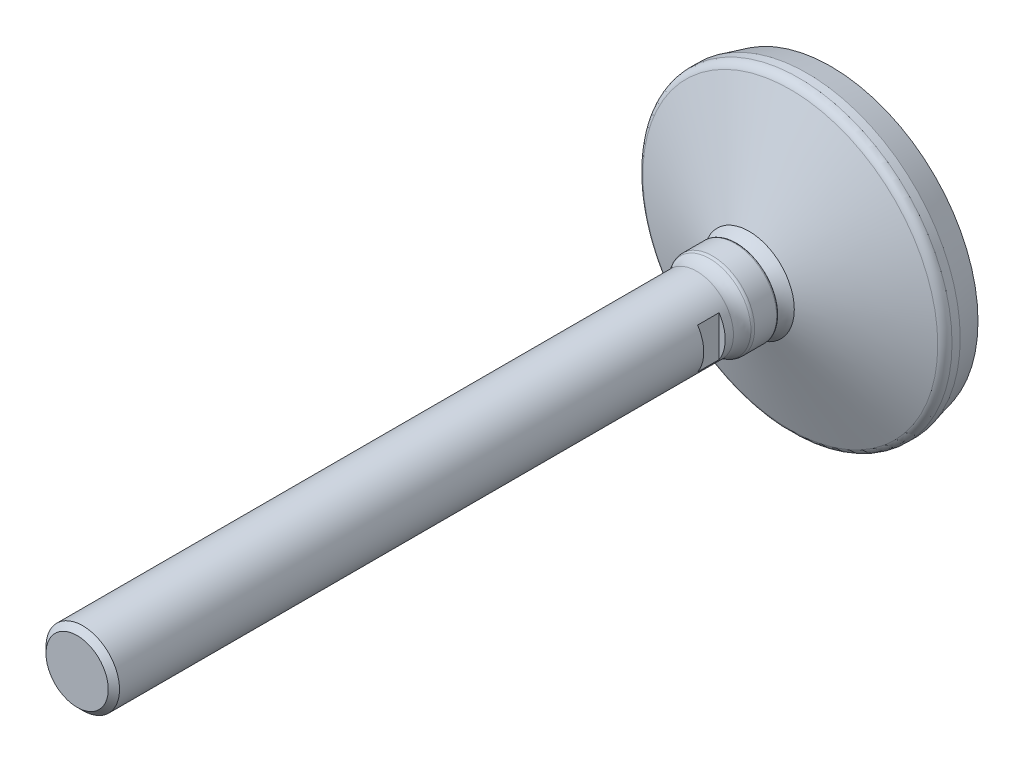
ISO-10303-21;
HEADER;
FILE_DESCRIPTION(('STEP AP214'),'2;1');
FILE_NAME('part.step','',(''),(''),'','','');
FILE_SCHEMA(('AUTOMOTIVE_DESIGN { 1 0 10303 214 1 1 1 1 }'));
ENDSEC;
DATA;
#1=APPLICATION_CONTEXT('core data for automotive mechanical design processes');
#2=APPLICATION_PROTOCOL_DEFINITION('international standard','automotive_design',2000,#1);
#3=PRODUCT_CONTEXT('',#1,'mechanical');
#4=PRODUCT('Part','Part','',(#3));
#5=PRODUCT_RELATED_PRODUCT_CATEGORY('part','',(#4));
#6=PRODUCT_DEFINITION_FORMATION('','',#4);
#7=PRODUCT_DEFINITION_CONTEXT('part definition',#1,'design');
#8=PRODUCT_DEFINITION('design','',#6,#7);
#9=PRODUCT_DEFINITION_SHAPE('','',#8);
#10=(LENGTH_UNIT() NAMED_UNIT(*) SI_UNIT(.MILLI.,.METRE.));
#11=(NAMED_UNIT(*) PLANE_ANGLE_UNIT() SI_UNIT($,.RADIAN.));
#12=(NAMED_UNIT(*) SI_UNIT($,.STERADIAN.) SOLID_ANGLE_UNIT());
#13=UNCERTAINTY_MEASURE_WITH_UNIT(LENGTH_MEASURE(1.E-05),#10,'distance_accuracy_value','');
#14=(GEOMETRIC_REPRESENTATION_CONTEXT(3) GLOBAL_UNCERTAINTY_ASSIGNED_CONTEXT((#13)) GLOBAL_UNIT_ASSIGNED_CONTEXT((#10,
#11,#12)) REPRESENTATION_CONTEXT('',''));
#15=CARTESIAN_POINT('',(0.,0.,0.));
#16=DIRECTION('',(0.,0.,1.));
#17=DIRECTION('',(1.,0.,0.));
#18=AXIS2_PLACEMENT_3D('',#15,#16,#17);
#19=CARTESIAN_POINT('',(0.,0.,35.3578436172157));
#20=DIRECTION('',(0.,0.,-1.));
#21=DIRECTION('',(1.,0.,0.));
#22=AXIS2_PLACEMENT_3D('',#19,#20,#21);
#23=TOROIDAL_SURFACE('',#22,23.0591361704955,12.);
#24=CARTESIAN_POINT('',(0.,0.,26.7));
#25=DIRECTION('',(0.,0.,-1.));
#26=DIRECTION('',(1.,0.,0.));
#27=AXIS2_PLACEMENT_3D('',#24,#25,#26);
#28=CIRCLE('',#27,14.75);
#29=CARTESIAN_POINT('',(14.75,0.,26.7));
#30=VERTEX_POINT('',#29);
#31=EDGE_CURVE('E86',#30,#30,#28,.T.);
#32=ORIENTED_EDGE('',*,*,#31,.F.);
#33=EDGE_LOOP('',(#32));
#34=FACE_BOUND('',#33,.T.);
#35=CARTESIAN_POINT('',(0.,0.,30.7));
#36=DIRECTION('',(0.,0.,-1.));
#37=DIRECTION('',(1.,0.,0.));
#38=AXIS2_PLACEMENT_3D('',#35,#36,#37);
#39=CIRCLE('',#38,12.);
#40=CARTESIAN_POINT('',(12.,0.,30.7));
#41=VERTEX_POINT('',#40);
#42=EDGE_CURVE('E61',#41,#41,#39,.T.);
#43=ORIENTED_EDGE('',*,*,#42,.T.);
#44=EDGE_LOOP('',(#43));
#45=FACE_BOUND('',#44,.T.);
#46=ADVANCED_FACE('F14',(#34,#45),#23,.F.);
#47=CARTESIAN_POINT('',(0.,0.,26.7));
#48=DIRECTION('',(0.,0.,-1.));
#49=DIRECTION('',(1.,0.,0.));
#50=AXIS2_PLACEMENT_3D('',#47,#48,#49);
#51=CONICAL_SURFACE('',#50,14.75,1.18784675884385);
#52=CARTESIAN_POINT('',(0.,0.,13.2569409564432));
#53=DIRECTION('',(0.,0.,-1.));
#54=DIRECTION('',(1.,0.,0.));
#55=AXIS2_PLACEMENT_3D('',#52,#53,#54);
#56=CIRCLE('',#55,48.1209740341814);
#57=CARTESIAN_POINT('',(48.1209740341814,0.,13.2569409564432));
#58=VERTEX_POINT('',#57);
#59=EDGE_CURVE('E89',#58,#58,#56,.T.);
#60=CARTESIAN_POINT('',(48.1209740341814,0.,13.2569409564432));
#61=CARTESIAN_POINT('',(47.7733597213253,0.,13.3969728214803));
#62=CARTESIAN_POINT('',(47.4257454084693,0.,13.5370046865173));
#63=CARTESIAN_POINT('',(46.7305167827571,0.,13.8170684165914));
#64=CARTESIAN_POINT('',(46.3829024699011,0.,13.9571002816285));
#65=CARTESIAN_POINT('',(45.687673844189,0.,14.2371640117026));
#66=CARTESIAN_POINT('',(45.3400595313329,0.,14.3771958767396));
#67=CARTESIAN_POINT('',(44.6448309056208,0.,14.6572596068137));
#68=CARTESIAN_POINT('',(44.2972165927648,0.,14.7972914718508));
#69=CARTESIAN_POINT('',(43.6019879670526,0.,15.0773552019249));
#70=CARTESIAN_POINT('',(43.2543736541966,0.,15.2173870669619));
#71=CARTESIAN_POINT('',(42.5591450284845,0.,15.497450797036));
#72=CARTESIAN_POINT('',(42.2115307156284,0.,15.6374826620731));
#73=CARTESIAN_POINT('',(41.5163020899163,0.,15.9175463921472));
#74=CARTESIAN_POINT('',(41.1686877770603,0.,16.0575782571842));
#75=CARTESIAN_POINT('',(40.4734591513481,0.,16.3376419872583));
#76=CARTESIAN_POINT('',(40.1258448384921,0.,16.4776738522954));
#77=CARTESIAN_POINT('',(39.43061621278,0.,16.7577375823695));
#78=CARTESIAN_POINT('',(39.0830018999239,0.,16.8977694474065));
#79=CARTESIAN_POINT('',(38.3877732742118,0.,17.1778331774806));
#80=CARTESIAN_POINT('',(38.0401589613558,0.,17.3178650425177));
#81=CARTESIAN_POINT('',(37.3449303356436,0.,17.5979287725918));
#82=CARTESIAN_POINT('',(36.9973160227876,0.,17.7379606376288));
#83=CARTESIAN_POINT('',(36.3020873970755,0.,18.0180243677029));
#84=CARTESIAN_POINT('',(35.9544730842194,0.,18.15805623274));
#85=CARTESIAN_POINT('',(35.2592444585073,0.,18.4381199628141));
#86=CARTESIAN_POINT('',(34.9116301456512,0.,18.5781518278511));
#87=CARTESIAN_POINT('',(34.2164015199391,0.,18.8582155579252));
#88=CARTESIAN_POINT('',(33.8687872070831,0.,18.9982474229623));
#89=CARTESIAN_POINT('',(33.173558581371,0.,19.2783111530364));
#90=CARTESIAN_POINT('',(32.8259442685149,0.,19.4183430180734));
#91=CARTESIAN_POINT('',(32.1307156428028,0.,19.6984067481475));
#92=CARTESIAN_POINT('',(31.7831013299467,0.,19.8384386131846));
#93=CARTESIAN_POINT('',(31.0878727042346,0.,20.1185023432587));
#94=CARTESIAN_POINT('',(30.7402583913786,0.,20.2585342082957));
#95=CARTESIAN_POINT('',(30.0450297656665,0.,20.5385979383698));
#96=CARTESIAN_POINT('',(29.6974154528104,0.,20.6786298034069));
#97=CARTESIAN_POINT('',(29.0021868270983,0.,20.958693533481));
#98=CARTESIAN_POINT('',(28.6545725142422,0.,21.098725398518));
#99=CARTESIAN_POINT('',(27.9593438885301,0.,21.3787891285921));
#100=CARTESIAN_POINT('',(27.6117295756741,0.,21.5188209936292));
#101=CARTESIAN_POINT('',(26.916500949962,0.,21.7988847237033));
#102=CARTESIAN_POINT('',(26.5688866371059,0.,21.9389165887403));
#103=CARTESIAN_POINT('',(25.8736580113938,0.,22.2189803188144));
#104=CARTESIAN_POINT('',(25.5260436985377,0.,22.3590121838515));
#105=CARTESIAN_POINT('',(24.8308150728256,0.,22.6390759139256));
#106=CARTESIAN_POINT('',(24.4832007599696,0.,22.7791077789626));
#107=CARTESIAN_POINT('',(23.7879721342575,0.,23.0591715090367));
#108=CARTESIAN_POINT('',(23.4403578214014,0.,23.1992033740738));
#109=CARTESIAN_POINT('',(22.7451291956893,0.,23.4792671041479));
#110=CARTESIAN_POINT('',(22.3975148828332,0.,23.6192989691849));
#111=CARTESIAN_POINT('',(21.7022862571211,0.,23.899362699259));
#112=CARTESIAN_POINT('',(21.3546719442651,0.,24.0393945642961));
#113=CARTESIAN_POINT('',(20.6594433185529,0.,24.3194582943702));
#114=CARTESIAN_POINT('',(20.3118290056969,0.,24.4594901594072));
#115=CARTESIAN_POINT('',(19.6166003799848,0.,24.7395538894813));
#116=CARTESIAN_POINT('',(19.2689860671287,0.,24.8795857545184));
#117=CARTESIAN_POINT('',(18.5737574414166,0.,25.1596494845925));
#118=CARTESIAN_POINT('',(18.2261431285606,0.,25.2996813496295));
#119=CARTESIAN_POINT('',(17.5309145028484,0.,25.5797450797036));
#120=CARTESIAN_POINT('',(17.1833001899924,0.,25.7197769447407));
#121=CARTESIAN_POINT('',(16.4880715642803,0.,25.9998406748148));
#122=CARTESIAN_POINT('',(16.1404572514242,0.,26.1398725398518));
#123=CARTESIAN_POINT('',(15.4452286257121,0.,26.4199362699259));
#124=CARTESIAN_POINT('',(15.0976143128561,0.,26.559968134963));
#125=CARTESIAN_POINT('',(14.75,0.,26.7));
#126=B_SPLINE_CURVE_WITH_KNOTS('',3,(#60,#61,#62,#63,#64,#65,#66,#67,#68,#69,#70,#71,#72,#73,
#74,#75,#76,#77,#78,#79,#80,#81,#82,#83,#84,#85,#86,#87,#88,#89,#90,#91,#92,#93,#94,#95,#96,#97,
#98,#99,#100,#101,#102,#103,#104,#105,#106,#107,#108,#109,#110,#111,#112,#113,#114,#115,#116,
#117,#118,#119,#120,#121,#122,#123,#124,#125),.UNSPECIFIED.,.F.,.F.,(4,2,2,2,2,2,2,2,2,2,2,2,2,
2,2,2,2,2,2,2,2,2,2,2,2,2,2,2,2,2,2,2,4),(0.,1.12427830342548,2.24855660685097,3.37283491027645,
4.49711321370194,5.62139151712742,6.7456698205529,7.86994812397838,8.99422642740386,
10.1185047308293,11.2427830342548,12.3670613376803,13.4913396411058,14.6156179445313,
15.7398962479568,16.8641745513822,17.9884528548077,19.1127311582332,20.2370094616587,
21.3612877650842,22.4855660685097,23.6098443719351,24.7341226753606,25.8584009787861,
26.9826792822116,28.1069575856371,29.2312358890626,30.3555141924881,31.4797924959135,
32.604070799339,33.7283491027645,34.85262740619,35.9769057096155),.UNSPECIFIED.);
#127=EDGE_CURVE('BSEAM147',#58,#30,#126,.T.);
#128=ORIENTED_EDGE('',*,*,#59,.F.);
#129=ORIENTED_EDGE('',*,*,#31,.T.);
#130=ORIENTED_EDGE('',*,*,#127,.T.);
#131=ORIENTED_EDGE('',*,*,#127,.F.);
#132=EDGE_LOOP('',(#128,#130,#129,#131));
#133=FACE_BOUND('',#132,.T.);
#134=ADVANCED_FACE('F147',(#133),#51,.T.);
#135=CARTESIAN_POINT('',(0.,0.,10.4742413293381));
#136=DIRECTION('',(0.,0.,-1.));
#137=DIRECTION('',(1.,0.,0.));
#138=AXIS2_PLACEMENT_3D('',#135,#136,#137);
#139=TOROIDAL_SURFACE('',#138,47.,3.);
#140=ORIENTED_EDGE('',*,*,#59,.T.);
#141=EDGE_LOOP('',(#140));
#142=FACE_BOUND('',#141,.T.);
#143=CARTESIAN_POINT('',(0.,0.,10.4742413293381));
#144=DIRECTION('',(0.,0.,-1.));
#145=DIRECTION('',(1.,0.,0.));
#146=AXIS2_PLACEMENT_3D('',#143,#144,#145);
#147=CIRCLE('',#146,50.);
#148=CARTESIAN_POINT('',(50.,0.,10.4742413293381));
#149=VERTEX_POINT('',#148);
#150=EDGE_CURVE('E92',#149,#149,#147,.T.);
#151=ORIENTED_EDGE('',*,*,#150,.F.);
#152=EDGE_LOOP('',(#151));
#153=FACE_BOUND('',#152,.T.);
#154=ADVANCED_FACE('F153',(#142,#153),#139,.T.);
#155=CARTESIAN_POINT('',(0.,0.,0.));
#156=DIRECTION('',(0.,0.,-1.));
#157=DIRECTION('',(1.,0.,0.));
#158=AXIS2_PLACEMENT_3D('',#155,#156,#157);
#159=CYLINDRICAL_SURFACE('',#158,50.);
#160=CARTESIAN_POINT('',(0.,0.,7.8));
#161=DIRECTION('',(0.,0.,-1.));
#162=DIRECTION('',(1.,0.,0.));
#163=AXIS2_PLACEMENT_3D('',#160,#161,#162);
#164=CIRCLE('',#163,50.);
#165=CARTESIAN_POINT('',(50.,0.,7.8));
#166=VERTEX_POINT('',#165);
#167=EDGE_CURVE('E95',#166,#166,#164,.T.);
#168=ORIENTED_EDGE('',*,*,#167,.F.);
#169=EDGE_LOOP('',(#168));
#170=FACE_BOUND('',#169,.T.);
#171=ORIENTED_EDGE('',*,*,#150,.T.);
#172=EDGE_LOOP('',(#171));
#173=FACE_BOUND('',#172,.T.);
#174=ADVANCED_FACE('F198',(#170,#173),#159,.T.);
#175=CARTESIAN_POINT('',(0.,0.,7.8));
#176=DIRECTION('',(0.,0.,1.));
#177=DIRECTION('',(-1.,0.,0.));
#178=AXIS2_PLACEMENT_3D('',#175,#176,#177);
#179=CONICAL_SURFACE('',#178,50.,0.251002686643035);
#180=CARTESIAN_POINT('',(0.,0.,0.));
#181=DIRECTION('',(0.,0.,-1.));
#182=DIRECTION('',(1.,0.,0.));
#183=AXIS2_PLACEMENT_3D('',#180,#181,#182);
#184=CIRCLE('',#183,48.);
#185=CARTESIAN_POINT('',(48.,0.,0.));
#186=VERTEX_POINT('',#185);
#187=EDGE_CURVE('E98',#186,#186,#184,.T.);
#188=ORIENTED_EDGE('',*,*,#187,.F.);
#189=EDGE_LOOP('',(#188));
#190=FACE_BOUND('',#189,.T.);
#191=ORIENTED_EDGE('',*,*,#167,.T.);
#192=EDGE_LOOP('',(#191));
#193=FACE_BOUND('',#192,.T.);
#194=ADVANCED_FACE('F194',(#190,#193),#179,.T.);
#195=CARTESIAN_POINT('',(48.,0.,0.));
#196=DIRECTION('',(0.,0.,1.));
#197=DIRECTION('',(-1.,0.,0.));
#198=AXIS2_PLACEMENT_3D('',#195,#196,#197);
#199=PLANE('',#198);
#200=ORIENTED_EDGE('',*,*,#187,.T.);
#201=EDGE_LOOP('',(#200));
#202=FACE_BOUND('',#201,.T.);
#203=ADVANCED_FACE('F187',(#202),#199,.F.);
#204=CARTESIAN_POINT('',(0.,0.,14.));
#205=DIRECTION('',(0.,0.,-1.));
#206=DIRECTION('',(0.,1.,0.));
#207=AXIS2_PLACEMENT_3D('',#204,#205,#206);
#208=CYLINDRICAL_SURFACE('',#207,12.);
#209=CARTESIAN_POINT('',(0.,0.,43.8));
#210=DIRECTION('',(0.,0.,-1.));
#211=DIRECTION('',(0.,1.,0.));
#212=AXIS2_PLACEMENT_3D('',#209,#210,#211);
#213=CIRCLE('',#212,12.);
#214=CARTESIAN_POINT('',(0.,12.,43.8));
#215=VERTEX_POINT('',#214);
#216=EDGE_CURVE('E107',#215,#215,#213,.T.);
#217=ORIENTED_EDGE('',*,*,#216,.F.);
#218=EDGE_LOOP('',(#217));
#219=FACE_BOUND('',#218,.T.);
#220=DIRECTION('',(0.,0.,-1.));
#221=VECTOR('',#220,1.);
#222=CARTESIAN_POINT('',(10.,-6.6332495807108,14.));
#223=LINE('',#222,#221);
#224=CARTESIAN_POINT('',(10.,-6.6332495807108,46.5));
#225=VERTEX_POINT('',#224);
#226=CARTESIAN_POINT('',(10.,-6.6332495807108,53.5));
#227=VERTEX_POINT('',#226);
#228=EDGE_CURVE('E77',#225,#227,#223,.F.);
#229=ORIENTED_EDGE('',*,*,#228,.T.);
#230=CARTESIAN_POINT('',(0.,0.,53.5));
#231=DIRECTION('',(0.,0.,1.));
#232=DIRECTION('',(0.,-1.,0.));
#233=AXIS2_PLACEMENT_3D('',#230,#231,#232);
#234=CIRCLE('',#233,12.);
#235=CARTESIAN_POINT('',(10.,6.6332495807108,53.5));
#236=VERTEX_POINT('',#235);
#237=EDGE_CURVE('E9',#227,#236,#234,.T.);
#238=ORIENTED_EDGE('',*,*,#237,.T.);
#239=DIRECTION('',(0.,0.,-1.));
#240=VECTOR('',#239,1.);
#241=CARTESIAN_POINT('',(10.,6.6332495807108,14.));
#242=LINE('',#241,#240);
#243=CARTESIAN_POINT('',(10.,6.6332495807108,46.5));
#244=VERTEX_POINT('',#243);
#245=EDGE_CURVE('E17',#236,#244,#242,.T.);
#246=ORIENTED_EDGE('',*,*,#245,.T.);
#247=CARTESIAN_POINT('',(0.,0.,46.5));
#248=DIRECTION('',(0.,0.,1.));
#249=DIRECTION('',(0.,-1.,0.));
#250=AXIS2_PLACEMENT_3D('',#247,#248,#249);
#251=CIRCLE('',#250,12.);
#252=EDGE_CURVE('E63',#225,#244,#251,.T.);
#253=ORIENTED_EDGE('',*,*,#252,.F.);
#254=EDGE_LOOP('',(#229,#238,#246,#253));
#255=FACE_BOUND('',#254,.T.);
#256=DIRECTION('',(0.,0.,-1.));
#257=VECTOR('',#256,1.);
#258=CARTESIAN_POINT('',(-10.,6.6332495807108,14.));
#259=LINE('',#258,#257);
#260=CARTESIAN_POINT('',(-10.,6.6332495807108,46.5));
#261=VERTEX_POINT('',#260);
#262=CARTESIAN_POINT('',(-10.,6.6332495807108,53.5));
#263=VERTEX_POINT('',#262);
#264=EDGE_CURVE('E60',#261,#263,#259,.F.);
#265=ORIENTED_EDGE('',*,*,#264,.T.);
#266=CARTESIAN_POINT('',(-10.,-6.6332495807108,53.5));
#267=VERTEX_POINT('',#266);
#268=EDGE_CURVE('E23',#263,#267,#234,.T.);
#269=ORIENTED_EDGE('',*,*,#268,.T.);
#270=DIRECTION('',(0.,0.,-1.));
#271=VECTOR('',#270,1.);
#272=CARTESIAN_POINT('',(-10.,-6.6332495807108,14.));
#273=LINE('',#272,#271);
#274=CARTESIAN_POINT('',(-10.,-6.6332495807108,46.5));
#275=VERTEX_POINT('',#274);
#276=EDGE_CURVE('E67',#267,#275,#273,.T.);
#277=ORIENTED_EDGE('',*,*,#276,.T.);
#278=EDGE_CURVE('E55',#261,#275,#251,.T.);
#279=ORIENTED_EDGE('',*,*,#278,.F.);
#280=EDGE_LOOP('',(#265,#269,#277,#279));
#281=FACE_BOUND('',#280,.T.);
#282=CARTESIAN_POINT('',(0.,0.,244.1595));
#283=DIRECTION('',(0.,0.,-1.));
#284=DIRECTION('',(0.,1.,0.));
#285=AXIS2_PLACEMENT_3D('',#282,#283,#284);
#286=CIRCLE('',#285,12.);
#287=CARTESIAN_POINT('',(0.,12.,244.1595));
#288=VERTEX_POINT('',#287);
#289=EDGE_CURVE('E104',#288,#288,#286,.T.);
#290=ORIENTED_EDGE('',*,*,#289,.T.);
#291=EDGE_LOOP('',(#290));
#292=FACE_BOUND('',#291,.T.);
#293=ADVANCED_FACE('F73',(#219,#255,#281,#292),#208,.T.);
#294=CARTESIAN_POINT('',(0.,0.,43.8));
#295=DIRECTION('',(0.,0.,-1.));
#296=DIRECTION('',(0.,1.,0.));
#297=AXIS2_PLACEMENT_3D('',#294,#295,#296);
#298=TOROIDAL_SURFACE('',#297,19.,7.);
#299=CARTESIAN_POINT('',(0.,0.,39.5456515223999));
#300=DIRECTION('',(0.,0.,-1.));
#301=DIRECTION('',(0.,1.,0.));
#302=AXIS2_PLACEMENT_3D('',#299,#300,#301);
#303=CIRCLE('',#302,13.4411764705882);
#304=CARTESIAN_POINT('',(0.,13.4411764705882,39.5456515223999));
#305=VERTEX_POINT('',#304);
#306=EDGE_CURVE('E110',#305,#305,#303,.T.);
#307=ORIENTED_EDGE('',*,*,#306,.F.);
#308=EDGE_LOOP('',(#307));
#309=FACE_BOUND('',#308,.T.);
#310=ORIENTED_EDGE('',*,*,#216,.T.);
#311=EDGE_LOOP('',(#310));
#312=FACE_BOUND('',#311,.T.);
#313=ADVANCED_FACE('F180',(#309,#312),#298,.F.);
#314=CARTESIAN_POINT('',(0.,0.,38.6340054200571));
#315=DIRECTION('',(0.,0.,-1.));
#316=DIRECTION('',(0.,1.,0.));
#317=AXIS2_PLACEMENT_3D('',#314,#315,#316);
#318=TOROIDAL_SURFACE('',#317,12.25,1.49999999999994);
#319=ORIENTED_EDGE('',*,*,#306,.T.);
#320=EDGE_LOOP('',(#319));
#321=FACE_BOUND('',#320,.T.);
#322=CARTESIAN_POINT('',(0.,0.,38.6340054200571));
#323=DIRECTION('',(0.,0.,-1.));
#324=DIRECTION('',(0.,1.,0.));
#325=AXIS2_PLACEMENT_3D('',#322,#323,#324);
#326=CIRCLE('',#325,13.75);
#327=CARTESIAN_POINT('',(0.,13.75,38.6340054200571));
#328=VERTEX_POINT('',#327);
#329=EDGE_CURVE('E113',#328,#328,#326,.T.);
#330=ORIENTED_EDGE('',*,*,#329,.F.);
#331=EDGE_LOOP('',(#330));
#332=FACE_BOUND('',#331,.T.);
#333=ADVANCED_FACE('F173',(#321,#332),#318,.T.);
#334=CARTESIAN_POINT('',(0.,0.,14.));
#335=DIRECTION('',(0.,0.,-1.));
#336=DIRECTION('',(0.,1.,0.));
#337=AXIS2_PLACEMENT_3D('',#334,#335,#336);
#338=CYLINDRICAL_SURFACE('',#337,13.75);
#339=CARTESIAN_POINT('',(0.,0.,31.45));
#340=DIRECTION('',(0.,0.,-1.));
#341=DIRECTION('',(0.,1.,0.));
#342=AXIS2_PLACEMENT_3D('',#339,#340,#341);
#343=CIRCLE('',#342,13.75);
#344=CARTESIAN_POINT('',(0.,13.75,31.45));
#345=VERTEX_POINT('',#344);
#346=EDGE_CURVE('E116',#345,#345,#343,.T.);
#347=ORIENTED_EDGE('',*,*,#346,.F.);
#348=EDGE_LOOP('',(#347));
#349=FACE_BOUND('',#348,.T.);
#350=ORIENTED_EDGE('',*,*,#329,.T.);
#351=EDGE_LOOP('',(#350));
#352=FACE_BOUND('',#351,.T.);
#353=ADVANCED_FACE('F166',(#349,#352),#338,.T.);
#354=CARTESIAN_POINT('',(0.,0.,31.45));
#355=DIRECTION('',(0.,0.,-1.));
#356=DIRECTION('',(0.,1.,0.));
#357=AXIS2_PLACEMENT_3D('',#354,#355,#356);
#358=TOROIDAL_SURFACE('',#357,13.,0.75);
#359=ORIENTED_EDGE('',*,*,#346,.T.);
#360=EDGE_LOOP('',(#359));
#361=FACE_BOUND('',#360,.T.);
#362=CARTESIAN_POINT('',(0.,0.,30.7));
#363=DIRECTION('',(0.,0.,-1.));
#364=DIRECTION('',(0.,1.,0.));
#365=AXIS2_PLACEMENT_3D('',#362,#363,#364);
#366=CIRCLE('',#365,13.);
#367=CARTESIAN_POINT('',(0.,13.,30.7));
#368=VERTEX_POINT('',#367);
#369=EDGE_CURVE('E119',#368,#368,#366,.T.);
#370=ORIENTED_EDGE('',*,*,#369,.F.);
#371=EDGE_LOOP('',(#370));
#372=FACE_BOUND('',#371,.T.);
#373=ADVANCED_FACE('F161',(#361,#372),#358,.T.);
#374=CARTESIAN_POINT('',(13.,0.,30.7));
#375=DIRECTION('',(0.,0.,1.));
#376=DIRECTION('',(0.,-1.,0.));
#377=AXIS2_PLACEMENT_3D('',#374,#375,#376);
#378=PLANE('',#377);
#379=ORIENTED_EDGE('',*,*,#42,.F.);
#380=EDGE_LOOP('',(#379));
#381=FACE_BOUND('',#380,.T.);
#382=ORIENTED_EDGE('',*,*,#369,.T.);
#383=EDGE_LOOP('',(#382));
#384=FACE_BOUND('',#383,.T.);
#385=ADVANCED_FACE('F145',(#381,#384),#378,.F.);
#386=CARTESIAN_POINT('',(0.,0.,46.5));
#387=DIRECTION('',(0.,0.,1.));
#388=DIRECTION('',(0.,-1.,0.));
#389=AXIS2_PLACEMENT_3D('',#386,#387,#388);
#390=PLANE('',#389);
#391=ORIENTED_EDGE('',*,*,#278,.T.);
#392=DIRECTION('',(0.,-1.,0.));
#393=VECTOR('',#392,1.);
#394=CARTESIAN_POINT('',(-10.,24.,46.5));
#395=LINE('',#394,#393);
#396=EDGE_CURVE('E29',#261,#275,#395,.T.);
#397=ORIENTED_EDGE('',*,*,#396,.F.);
#398=EDGE_LOOP('',(#391,#397));
#399=FACE_BOUND('',#398,.T.);
#400=ADVANCED_FACE('F56',(#399),#390,.T.);
#401=CARTESIAN_POINT('',(0.,0.,53.5));
#402=DIRECTION('',(0.,0.,1.));
#403=DIRECTION('',(0.,-1.,0.));
#404=AXIS2_PLACEMENT_3D('',#401,#402,#403);
#405=PLANE('',#404);
#406=DIRECTION('',(0.,-1.,0.));
#407=VECTOR('',#406,1.);
#408=CARTESIAN_POINT('',(-10.,24.,53.5));
#409=LINE('',#408,#407);
#410=EDGE_CURVE('E121',#263,#267,#409,.T.);
#411=ORIENTED_EDGE('',*,*,#410,.T.);
#412=ORIENTED_EDGE('',*,*,#268,.F.);
#413=EDGE_LOOP('',(#411,#412));
#414=FACE_BOUND('',#413,.T.);
#415=ADVANCED_FACE('F142',(#414),#405,.F.);
#416=CARTESIAN_POINT('',(-10.,24.,53.5));
#417=DIRECTION('',(1.,0.,0.));
#418=DIRECTION('',(0.,1.,0.));
#419=AXIS2_PLACEMENT_3D('',#416,#417,#418);
#420=PLANE('',#419);
#421=ORIENTED_EDGE('',*,*,#410,.F.);
#422=ORIENTED_EDGE('',*,*,#264,.F.);
#423=ORIENTED_EDGE('',*,*,#396,.T.);
#424=ORIENTED_EDGE('',*,*,#276,.F.);
#425=EDGE_LOOP('',(#421,#422,#423,#424));
#426=FACE_BOUND('',#425,.T.);
#427=ADVANCED_FACE('F66',(#426),#420,.F.);
#428=CARTESIAN_POINT('',(10.,-24.,53.5));
#429=DIRECTION('',(-1.,0.,0.));
#430=DIRECTION('',(0.,-1.,0.));
#431=AXIS2_PLACEMENT_3D('',#428,#429,#430);
#432=PLANE('',#431);
#433=DIRECTION('',(0.,1.,0.));
#434=VECTOR('',#433,1.);
#435=CARTESIAN_POINT('',(10.,-24.,53.5));
#436=LINE('',#435,#434);
#437=EDGE_CURVE('E69',#227,#236,#436,.T.);
#438=ORIENTED_EDGE('',*,*,#437,.F.);
#439=ORIENTED_EDGE('',*,*,#228,.F.);
#440=DIRECTION('',(0.,1.,0.));
#441=VECTOR('',#440,1.);
#442=CARTESIAN_POINT('',(10.,-24.,46.5));
#443=LINE('',#442,#441);
#444=EDGE_CURVE('E70',#225,#244,#443,.T.);
#445=ORIENTED_EDGE('',*,*,#444,.T.);
#446=ORIENTED_EDGE('',*,*,#245,.F.);
#447=EDGE_LOOP('',(#438,#439,#445,#446));
#448=FACE_BOUND('',#447,.T.);
#449=ADVANCED_FACE('F127',(#448),#432,.F.);
#450=ORIENTED_EDGE('',*,*,#437,.T.);
#451=ORIENTED_EDGE('',*,*,#237,.F.);
#452=EDGE_LOOP('',(#450,#451));
#453=FACE_BOUND('',#452,.T.);
#454=ADVANCED_FACE('F126',(#453),#405,.F.);
#455=ORIENTED_EDGE('',*,*,#444,.F.);
#456=ORIENTED_EDGE('',*,*,#252,.T.);
#457=EDGE_LOOP('',(#455,#456));
#458=FACE_BOUND('',#457,.T.);
#459=ADVANCED_FACE('F128',(#458),#390,.T.);
#460=CARTESIAN_POINT('',(0.,0.,246.));
#461=DIRECTION('',(0.,0.,-1.));
#462=DIRECTION('',(0.,1.,0.));
#463=AXIS2_PLACEMENT_3D('',#460,#461,#462);
#464=PLANE('',#463);
#465=CARTESIAN_POINT('',(0.,0.,246.));
#466=DIRECTION('',(0.,0.,-1.));
#467=DIRECTION('',(0.,1.,0.));
#468=AXIS2_PLACEMENT_3D('',#465,#466,#467);
#469=CIRCLE('',#468,10.1595);
#470=CARTESIAN_POINT('',(0.,10.1595,246.));
#471=VERTEX_POINT('',#470);
#472=EDGE_CURVE('E101',#471,#471,#469,.T.);
#473=ORIENTED_EDGE('',*,*,#472,.F.);
#474=EDGE_LOOP('',(#473));
#475=FACE_BOUND('',#474,.T.);
#476=ADVANCED_FACE('F130',(#475),#464,.F.);
#477=CARTESIAN_POINT('',(0.,0.,246.));
#478=DIRECTION('',(0.,0.,-1.));
#479=DIRECTION('',(0.,1.,0.));
#480=AXIS2_PLACEMENT_3D('',#477,#478,#479);
#481=CONICAL_SURFACE('',#480,10.1595,0.78539816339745);
#482=ORIENTED_EDGE('',*,*,#289,.F.);
#483=EDGE_LOOP('',(#482));
#484=FACE_BOUND('',#483,.T.);
#485=ORIENTED_EDGE('',*,*,#472,.T.);
#486=EDGE_LOOP('',(#485));
#487=FACE_BOUND('',#486,.T.);
#488=ADVANCED_FACE('F138',(#484,#487),#481,.T.);
#489=CLOSED_SHELL('',(#46,#134,#154,#174,#194,#203,#293,#313,#333,#353,#373,#385,#400,#415,#427,
#449,#454,#459,#476,#488));
#490=MANIFOLD_SOLID_BREP('B1',#489);
#491=ADVANCED_BREP_SHAPE_REPRESENTATION('',(#18,#490),#14);
#492=SHAPE_DEFINITION_REPRESENTATION(#9,#491);
ENDSEC;
END-ISO-10303-21;
